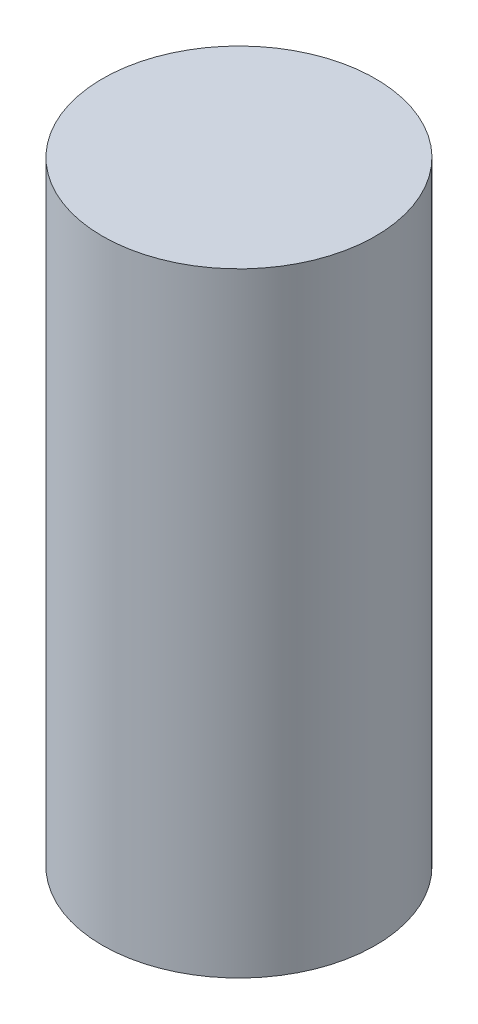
from build123d import *

# Parameters (mm, degrees)
SKETCH1_R           = 1
BOSS_EXTRUDE1_DEPTH = 4.5


with BuildPart() as part:
    # Sketch1 → Boss-Extrude1 (new body)
    with BuildSketch(Plane(origin=(0, 0, 0), x_dir=(1, 0, 0), z_dir=(0, 1, 0))):
        with Locations(Location((0, 0, 0), (0, 0, 270))):
            Circle(SKETCH1_R)
    extrude(amount=BOSS_EXTRUDE1_DEPTH)


solid = part.part
